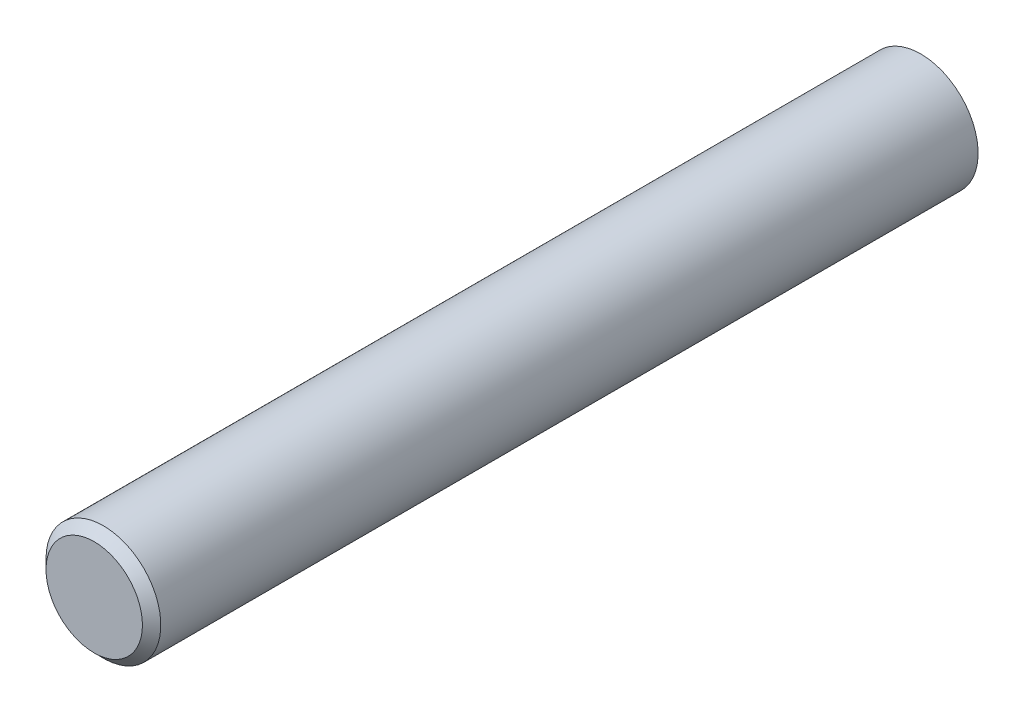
ISO-10303-21;
HEADER;
FILE_DESCRIPTION(('STEP AP214'),'2;1');
FILE_NAME('part.step','',(''),(''),'','','');
FILE_SCHEMA(('AUTOMOTIVE_DESIGN { 1 0 10303 214 1 1 1 1 }'));
ENDSEC;
DATA;
#1=APPLICATION_CONTEXT('core data for automotive mechanical design processes');
#2=APPLICATION_PROTOCOL_DEFINITION('international standard','automotive_design',2000,#1);
#3=PRODUCT_CONTEXT('',#1,'mechanical');
#4=PRODUCT('Part','Part','',(#3));
#5=PRODUCT_RELATED_PRODUCT_CATEGORY('part','',(#4));
#6=PRODUCT_DEFINITION_FORMATION('','',#4);
#7=PRODUCT_DEFINITION_CONTEXT('part definition',#1,'design');
#8=PRODUCT_DEFINITION('design','',#6,#7);
#9=PRODUCT_DEFINITION_SHAPE('','',#8);
#10=(LENGTH_UNIT() NAMED_UNIT(*) SI_UNIT(.MILLI.,.METRE.));
#11=(NAMED_UNIT(*) PLANE_ANGLE_UNIT() SI_UNIT($,.RADIAN.));
#12=(NAMED_UNIT(*) SI_UNIT($,.STERADIAN.) SOLID_ANGLE_UNIT());
#13=UNCERTAINTY_MEASURE_WITH_UNIT(LENGTH_MEASURE(1.E-05),#10,'distance_accuracy_value','');
#14=(GEOMETRIC_REPRESENTATION_CONTEXT(3) GLOBAL_UNCERTAINTY_ASSIGNED_CONTEXT((#13)) GLOBAL_UNIT_ASSIGNED_CONTEXT((#10,
#11,#12)) REPRESENTATION_CONTEXT('',''));
#15=CARTESIAN_POINT('',(0.,0.,0.));
#16=DIRECTION('',(0.,0.,1.));
#17=DIRECTION('',(1.,0.,0.));
#18=AXIS2_PLACEMENT_3D('',#15,#16,#17);
#19=CARTESIAN_POINT('',(0.,0.,180.));
#20=DIRECTION('',(0.,0.,-1.));
#21=DIRECTION('',(-1.,0.,0.));
#22=AXIS2_PLACEMENT_3D('',#19,#20,#21);
#23=CYLINDRICAL_SURFACE('',#22,12.5);
#24=CARTESIAN_POINT('',(0.,0.,178.));
#25=DIRECTION('',(0.,0.,1.));
#26=DIRECTION('',(1.,0.,0.));
#27=AXIS2_PLACEMENT_3D('',#24,#25,#26);
#28=CIRCLE('',#27,12.5);
#29=CARTESIAN_POINT('',(-12.5,0.,178.));
#30=VERTEX_POINT('',#29);
#31=EDGE_CURVE('E10',#30,#30,#28,.F.);
#32=CARTESIAN_POINT('',(0.,0.,0.));
#33=DIRECTION('',(0.,0.,1.));
#34=DIRECTION('',(1.,0.,0.));
#35=AXIS2_PLACEMENT_3D('',#32,#33,#34);
#36=CIRCLE('',#35,12.5);
#37=CARTESIAN_POINT('',(-12.5,0.,0.));
#38=VERTEX_POINT('',#37);
#39=EDGE_CURVE('E41',#38,#38,#36,.T.);
#40=CARTESIAN_POINT('',(-12.5,0.,178.));
#41=CARTESIAN_POINT('',(-12.5,0.,176.145833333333));
#42=CARTESIAN_POINT('',(-12.5,0.,174.291666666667));
#43=CARTESIAN_POINT('',(-12.5,0.,170.583333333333));
#44=CARTESIAN_POINT('',(-12.5,0.,168.729166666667));
#45=CARTESIAN_POINT('',(-12.5,0.,165.020833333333));
#46=CARTESIAN_POINT('',(-12.5,0.,163.166666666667));
#47=CARTESIAN_POINT('',(-12.5,0.,159.458333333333));
#48=CARTESIAN_POINT('',(-12.5,0.,157.604166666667));
#49=CARTESIAN_POINT('',(-12.5,0.,153.895833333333));
#50=CARTESIAN_POINT('',(-12.5,0.,152.041666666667));
#51=CARTESIAN_POINT('',(-12.5,0.,148.333333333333));
#52=CARTESIAN_POINT('',(-12.5,0.,146.479166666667));
#53=CARTESIAN_POINT('',(-12.5,0.,142.770833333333));
#54=CARTESIAN_POINT('',(-12.5,0.,140.916666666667));
#55=CARTESIAN_POINT('',(-12.5,0.,137.208333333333));
#56=CARTESIAN_POINT('',(-12.5,0.,135.354166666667));
#57=CARTESIAN_POINT('',(-12.5,0.,131.645833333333));
#58=CARTESIAN_POINT('',(-12.5,0.,129.791666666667));
#59=CARTESIAN_POINT('',(-12.5,0.,126.083333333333));
#60=CARTESIAN_POINT('',(-12.5,0.,124.229166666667));
#61=CARTESIAN_POINT('',(-12.5,0.,120.520833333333));
#62=CARTESIAN_POINT('',(-12.5,0.,118.666666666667));
#63=CARTESIAN_POINT('',(-12.5,0.,114.958333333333));
#64=CARTESIAN_POINT('',(-12.5,0.,113.104166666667));
#65=CARTESIAN_POINT('',(-12.5,0.,109.395833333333));
#66=CARTESIAN_POINT('',(-12.5,0.,107.541666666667));
#67=CARTESIAN_POINT('',(-12.5,0.,103.833333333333));
#68=CARTESIAN_POINT('',(-12.5,0.,101.979166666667));
#69=CARTESIAN_POINT('',(-12.5,0.,98.2708333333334));
#70=CARTESIAN_POINT('',(-12.5,0.,96.4166666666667));
#71=CARTESIAN_POINT('',(-12.5,0.,92.7083333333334));
#72=CARTESIAN_POINT('',(-12.5,0.,90.8541666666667));
#73=CARTESIAN_POINT('',(-12.5,0.,87.1458333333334));
#74=CARTESIAN_POINT('',(-12.5,0.,85.2916666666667));
#75=CARTESIAN_POINT('',(-12.5,0.,81.5833333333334));
#76=CARTESIAN_POINT('',(-12.5,0.,79.7291666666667));
#77=CARTESIAN_POINT('',(-12.5,0.,76.0208333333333));
#78=CARTESIAN_POINT('',(-12.5,0.,74.1666666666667));
#79=CARTESIAN_POINT('',(-12.5,0.,70.4583333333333));
#80=CARTESIAN_POINT('',(-12.5,0.,68.6041666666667));
#81=CARTESIAN_POINT('',(-12.5,0.,64.8958333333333));
#82=CARTESIAN_POINT('',(-12.5,0.,63.0416666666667));
#83=CARTESIAN_POINT('',(-12.5,0.,59.3333333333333));
#84=CARTESIAN_POINT('',(-12.5,0.,57.4791666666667));
#85=CARTESIAN_POINT('',(-12.5,0.,53.7708333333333));
#86=CARTESIAN_POINT('',(-12.5,0.,51.9166666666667));
#87=CARTESIAN_POINT('',(-12.5,0.,48.2083333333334));
#88=CARTESIAN_POINT('',(-12.5,0.,46.3541666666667));
#89=CARTESIAN_POINT('',(-12.5,0.,42.6458333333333));
#90=CARTESIAN_POINT('',(-12.5,0.,40.7916666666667));
#91=CARTESIAN_POINT('',(-12.5,0.,37.0833333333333));
#92=CARTESIAN_POINT('',(-12.5,0.,35.2291666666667));
#93=CARTESIAN_POINT('',(-12.5,0.,31.5208333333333));
#94=CARTESIAN_POINT('',(-12.5,0.,29.6666666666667));
#95=CARTESIAN_POINT('',(-12.5,0.,25.9583333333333));
#96=CARTESIAN_POINT('',(-12.5,0.,24.1041666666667));
#97=CARTESIAN_POINT('',(-12.5,0.,20.3958333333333));
#98=CARTESIAN_POINT('',(-12.5,0.,18.5416666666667));
#99=CARTESIAN_POINT('',(-12.5,0.,14.8333333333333));
#100=CARTESIAN_POINT('',(-12.5,0.,12.9791666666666));
#101=CARTESIAN_POINT('',(-12.5,0.,9.27083333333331));
#102=CARTESIAN_POINT('',(-12.5,0.,7.41666666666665));
#103=CARTESIAN_POINT('',(-12.5,0.,3.70833333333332));
#104=CARTESIAN_POINT('',(-12.5,0.,1.85416666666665));
#105=CARTESIAN_POINT('',(-12.5,0.,0.));
#106=B_SPLINE_CURVE_WITH_KNOTS('',3,(#40,#41,#42,#43,#44,#45,#46,#47,#48,#49,#50,#51,#52,#53,
#54,#55,#56,#57,#58,#59,#60,#61,#62,#63,#64,#65,#66,#67,#68,#69,#70,#71,#72,#73,#74,#75,#76,#77,
#78,#79,#80,#81,#82,#83,#84,#85,#86,#87,#88,#89,#90,#91,#92,#93,#94,#95,#96,#97,#98,#99,#100,
#101,#102,#103,#104,#105),.UNSPECIFIED.,.F.,.F.,(4,2,2,2,2,2,2,2,2,2,2,2,2,2,2,2,2,2,2,2,2,2,2,
2,2,2,2,2,2,2,2,2,4),(0.,5.56250000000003,11.125,16.6875,22.25,27.8125,33.375,38.9375,44.5,
50.0625,55.625,61.1875,66.75,72.3125,77.875,83.4375000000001,89.0000000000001,94.5625,100.125,
105.6875,111.25,116.8125,122.375,127.9375,133.5,139.0625,144.625,150.1875,155.75,161.3125,
166.875,172.4375,178.),.UNSPECIFIED.);
#107=EDGE_CURVE('BSEAM30',#30,#38,#106,.T.);
#108=ORIENTED_EDGE('',*,*,#31,.T.);
#109=ORIENTED_EDGE('',*,*,#39,.T.);
#110=ORIENTED_EDGE('',*,*,#107,.T.);
#111=ORIENTED_EDGE('',*,*,#107,.F.);
#112=EDGE_LOOP('',(#108,#110,#109,#111));
#113=FACE_BOUND('',#112,.T.);
#114=ADVANCED_FACE('F30',(#113),#23,.T.);
#115=CARTESIAN_POINT('',(0.,0.,180.));
#116=DIRECTION('',(0.,0.,1.));
#117=DIRECTION('',(1.,0.,0.));
#118=AXIS2_PLACEMENT_3D('',#115,#116,#117);
#119=PLANE('',#118);
#120=CARTESIAN_POINT('',(0.,0.,180.));
#121=DIRECTION('',(0.,0.,1.));
#122=DIRECTION('',(1.,0.,0.));
#123=AXIS2_PLACEMENT_3D('',#120,#121,#122);
#124=CIRCLE('',#123,10.5000000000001);
#125=CARTESIAN_POINT('',(10.5000000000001,0.,180.));
#126=VERTEX_POINT('',#125);
#127=EDGE_CURVE('E37',#126,#126,#124,.T.);
#128=ORIENTED_EDGE('',*,*,#127,.T.);
#129=EDGE_LOOP('',(#128));
#130=FACE_BOUND('',#129,.T.);
#131=ADVANCED_FACE('F65',(#130),#119,.T.);
#132=CARTESIAN_POINT('',(0.,0.,0.));
#133=DIRECTION('',(0.,0.,1.));
#134=DIRECTION('',(1.,0.,0.));
#135=AXIS2_PLACEMENT_3D('',#132,#133,#134);
#136=PLANE('',#135);
#137=CARTESIAN_POINT('',(0.,0.,0.));
#138=DIRECTION('',(0.,0.,-1.));
#139=DIRECTION('',(-1.,0.,0.));
#140=AXIS2_PLACEMENT_3D('',#137,#138,#139);
#141=CIRCLE('',#140,4.);
#142=CARTESIAN_POINT('',(-4.,0.,0.));
#143=VERTEX_POINT('',#142);
#144=EDGE_CURVE('E48',#143,#143,#141,.T.);
#145=ORIENTED_EDGE('',*,*,#144,.F.);
#146=EDGE_LOOP('',(#145));
#147=FACE_BOUND('',#146,.T.);
#148=ORIENTED_EDGE('',*,*,#39,.F.);
#149=EDGE_LOOP('',(#148));
#150=FACE_BOUND('',#149,.T.);
#151=ADVANCED_FACE('F62',(#147,#150),#136,.F.);
#152=CARTESIAN_POINT('',(0.,0.,180.));
#153=DIRECTION('',(0.,0.,-1.));
#154=DIRECTION('',(-1.,0.,0.));
#155=AXIS2_PLACEMENT_3D('',#152,#153,#154);
#156=CONICAL_SURFACE('',#155,10.5000000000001,0.785398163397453);
#157=ORIENTED_EDGE('',*,*,#31,.F.);
#158=EDGE_LOOP('',(#157));
#159=FACE_BOUND('',#158,.T.);
#160=ORIENTED_EDGE('',*,*,#127,.F.);
#161=EDGE_LOOP('',(#160));
#162=FACE_BOUND('',#161,.T.);
#163=ADVANCED_FACE('F32',(#159,#162),#156,.T.);
#164=CARTESIAN_POINT('',(0.,0.,15.));
#165=DIRECTION('',(0.,0.,-1.));
#166=DIRECTION('',(-1.,0.,0.));
#167=AXIS2_PLACEMENT_3D('',#164,#165,#166);
#168=CYLINDRICAL_SURFACE('',#167,4.);
#169=CARTESIAN_POINT('',(0.,0.,15.));
#170=DIRECTION('',(0.,0.,-1.));
#171=DIRECTION('',(-1.,0.,0.));
#172=AXIS2_PLACEMENT_3D('',#169,#170,#171);
#173=CIRCLE('',#172,4.);
#174=CARTESIAN_POINT('',(-4.,0.,15.));
#175=VERTEX_POINT('',#174);
#176=EDGE_CURVE('E45',#175,#175,#173,.T.);
#177=ORIENTED_EDGE('',*,*,#176,.F.);
#178=EDGE_LOOP('',(#177));
#179=FACE_BOUND('',#178,.T.);
#180=ORIENTED_EDGE('',*,*,#144,.T.);
#181=EDGE_LOOP('',(#180));
#182=FACE_BOUND('',#181,.T.);
#183=ADVANCED_FACE('F56',(#179,#182),#168,.F.);
#184=CARTESIAN_POINT('',(0.,0.,15.));
#185=DIRECTION('',(0.,0.,-1.));
#186=DIRECTION('',(-1.,0.,0.));
#187=AXIS2_PLACEMENT_3D('',#184,#185,#186);
#188=PLANE('',#187);
#189=ORIENTED_EDGE('',*,*,#176,.T.);
#190=EDGE_LOOP('',(#189));
#191=FACE_BOUND('',#190,.T.);
#192=ADVANCED_FACE('F54',(#191),#188,.T.);
#193=CLOSED_SHELL('',(#114,#131,#151,#163,#183,#192));
#194=MANIFOLD_SOLID_BREP('B2',#193);
#195=ADVANCED_BREP_SHAPE_REPRESENTATION('',(#18,#194),#14);
#196=SHAPE_DEFINITION_REPRESENTATION(#9,#195);
ENDSEC;
END-ISO-10303-21;
